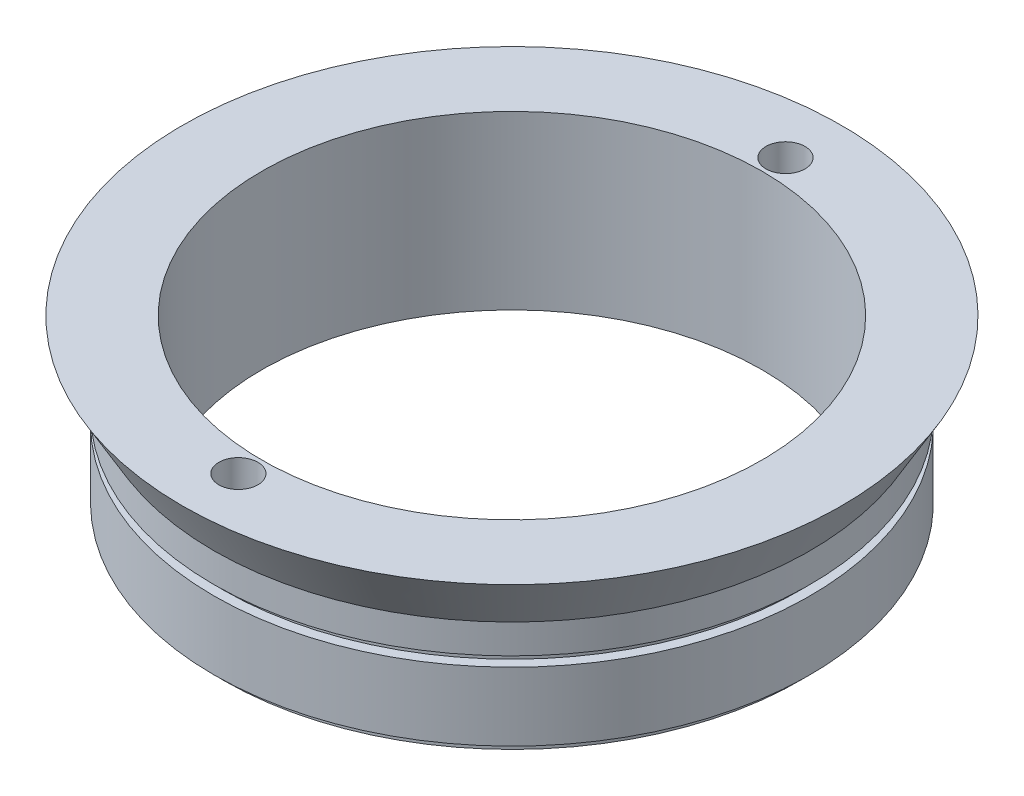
ISO-10303-21;
HEADER;
FILE_DESCRIPTION(('STEP AP214'),'2;1');
FILE_NAME('part.step','',(''),(''),'','','');
FILE_SCHEMA(('AUTOMOTIVE_DESIGN { 1 0 10303 214 1 1 1 1 }'));
ENDSEC;
DATA;
#1=APPLICATION_CONTEXT('core data for automotive mechanical design processes');
#2=APPLICATION_PROTOCOL_DEFINITION('international standard','automotive_design',2000,#1);
#3=PRODUCT_CONTEXT('',#1,'mechanical');
#4=PRODUCT('Part','Part','',(#3));
#5=PRODUCT_RELATED_PRODUCT_CATEGORY('part','',(#4));
#6=PRODUCT_DEFINITION_FORMATION('','',#4);
#7=PRODUCT_DEFINITION_CONTEXT('part definition',#1,'design');
#8=PRODUCT_DEFINITION('design','',#6,#7);
#9=PRODUCT_DEFINITION_SHAPE('','',#8);
#10=(LENGTH_UNIT() NAMED_UNIT(*) SI_UNIT(.MILLI.,.METRE.));
#11=(NAMED_UNIT(*) PLANE_ANGLE_UNIT() SI_UNIT($,.RADIAN.));
#12=(NAMED_UNIT(*) SI_UNIT($,.STERADIAN.) SOLID_ANGLE_UNIT());
#13=UNCERTAINTY_MEASURE_WITH_UNIT(LENGTH_MEASURE(1.E-05),#10,'distance_accuracy_value','');
#14=(GEOMETRIC_REPRESENTATION_CONTEXT(3) GLOBAL_UNCERTAINTY_ASSIGNED_CONTEXT((#13)) GLOBAL_UNIT_ASSIGNED_CONTEXT((#10,
#11,#12)) REPRESENTATION_CONTEXT('',''));
#15=CARTESIAN_POINT('',(0.,0.,0.));
#16=DIRECTION('',(0.,0.,1.));
#17=DIRECTION('',(1.,0.,0.));
#18=AXIS2_PLACEMENT_3D('',#15,#16,#17);
#19=CARTESIAN_POINT('',(0.,8.8,0.));
#20=DIRECTION('',(0.,1.,0.));
#21=DIRECTION('',(0.,0.,1.));
#22=AXIS2_PLACEMENT_3D('',#19,#20,#21);
#23=CYLINDRICAL_SURFACE('',#22,15.25);
#24=CARTESIAN_POINT('',(0.,0.5,0.));
#25=DIRECTION('',(0.,1.,0.));
#26=DIRECTION('',(0.,0.,1.));
#27=AXIS2_PLACEMENT_3D('',#24,#25,#26);
#28=CIRCLE('',#27,15.25);
#29=CARTESIAN_POINT('',(0.,0.5,15.25));
#30=VERTEX_POINT('',#29);
#31=EDGE_CURVE('E75',#30,#30,#28,.T.);
#32=ORIENTED_EDGE('',*,*,#31,.T.);
#33=EDGE_LOOP('',(#32));
#34=FACE_BOUND('',#33,.T.);
#35=CARTESIAN_POINT('',(0.,4.,0.));
#36=DIRECTION('',(0.,1.,0.));
#37=DIRECTION('',(0.,0.,1.));
#38=AXIS2_PLACEMENT_3D('',#35,#36,#37);
#39=CIRCLE('',#38,15.25);
#40=CARTESIAN_POINT('',(0.,4.,15.25));
#41=VERTEX_POINT('',#40);
#42=EDGE_CURVE('E87',#41,#41,#39,.T.);
#43=ORIENTED_EDGE('',*,*,#42,.F.);
#44=EDGE_LOOP('',(#43));
#45=FACE_BOUND('',#44,.T.);
#46=ADVANCED_FACE('F34',(#34,#45),#23,.T.);
#47=CARTESIAN_POINT('',(0.,0.,0.));
#48=DIRECTION('',(0.,1.,0.));
#49=DIRECTION('',(0.,0.,1.));
#50=AXIS2_PLACEMENT_3D('',#47,#48,#49);
#51=PLANE('',#50);
#52=CARTESIAN_POINT('',(0.,0.,0.));
#53=DIRECTION('',(0.,1.,0.));
#54=DIRECTION('',(0.,0.,1.));
#55=AXIS2_PLACEMENT_3D('',#52,#53,#54);
#56=CIRCLE('',#55,14.75);
#57=CARTESIAN_POINT('',(0.,0.,14.75));
#58=VERTEX_POINT('',#57);
#59=EDGE_CURVE('E69',#58,#58,#56,.T.);
#60=ORIENTED_EDGE('',*,*,#59,.F.);
#61=EDGE_LOOP('',(#60));
#62=FACE_BOUND('',#61,.T.);
#63=CARTESIAN_POINT('',(0.,0.,0.));
#64=DIRECTION('',(0.,-1.,0.));
#65=DIRECTION('',(0.,0.,-1.));
#66=AXIS2_PLACEMENT_3D('',#63,#64,#65);
#67=CIRCLE('',#66,12.8016);
#68=CARTESIAN_POINT('',(0.,0.,-12.8016));
#69=VERTEX_POINT('',#68);
#70=EDGE_CURVE('E90',#69,#69,#67,.T.);
#71=ORIENTED_EDGE('',*,*,#70,.F.);
#72=EDGE_LOOP('',(#71));
#73=FACE_BOUND('',#72,.T.);
#74=ADVANCED_FACE('F36',(#62,#73),#51,.F.);
#75=CARTESIAN_POINT('',(0.,4.5,0.));
#76=DIRECTION('',(0.,1.,0.));
#77=DIRECTION('',(0.,0.,1.));
#78=AXIS2_PLACEMENT_3D('',#75,#76,#77);
#79=CIRCLE('',#78,15.25);
#80=CARTESIAN_POINT('',(0.,4.5,15.25));
#81=VERTEX_POINT('',#80);
#82=EDGE_CURVE('E78',#81,#81,#79,.T.);
#83=ORIENTED_EDGE('',*,*,#82,.T.);
#84=EDGE_LOOP('',(#83));
#85=FACE_BOUND('',#84,.T.);
#86=CARTESIAN_POINT('',(0.,6.,0.));
#87=DIRECTION('',(0.,1.,0.));
#88=DIRECTION('',(0.,0.,1.));
#89=AXIS2_PLACEMENT_3D('',#86,#87,#88);
#90=CIRCLE('',#89,15.25);
#91=CARTESIAN_POINT('',(0.,6.,15.25));
#92=VERTEX_POINT('',#91);
#93=EDGE_CURVE('E11',#92,#92,#90,.T.);
#94=ORIENTED_EDGE('',*,*,#93,.F.);
#95=EDGE_LOOP('',(#94));
#96=FACE_BOUND('',#95,.T.);
#97=ADVANCED_FACE('F103',(#85,#96),#23,.T.);
#98=CARTESIAN_POINT('',(0.,6.,0.));
#99=DIRECTION('',(0.,1.,0.));
#100=DIRECTION('',(0.,0.,1.));
#101=AXIS2_PLACEMENT_3D('',#98,#99,#100);
#102=CONICAL_SURFACE('',#101,15.25,0.523598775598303);
#103=CARTESIAN_POINT('',(0.,8.8,0.));
#104=DIRECTION('',(0.,1.,0.));
#105=DIRECTION('',(0.,0.,1.));
#106=AXIS2_PLACEMENT_3D('',#103,#104,#105);
#107=CIRCLE('',#106,16.866580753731);
#108=CARTESIAN_POINT('',(0.,8.8,16.866580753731));
#109=VERTEX_POINT('',#108);
#110=EDGE_CURVE('E42',#109,#109,#107,.T.);
#111=ORIENTED_EDGE('',*,*,#110,.F.);
#112=EDGE_LOOP('',(#111));
#113=FACE_BOUND('',#112,.T.);
#114=ORIENTED_EDGE('',*,*,#93,.T.);
#115=EDGE_LOOP('',(#114));
#116=FACE_BOUND('',#115,.T.);
#117=ADVANCED_FACE('F100',(#113,#116),#102,.T.);
#118=CARTESIAN_POINT('',(0.,8.8,-16.866580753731));
#119=DIRECTION('',(0.,-1.,0.));
#120=DIRECTION('',(0.,0.,-1.));
#121=AXIS2_PLACEMENT_3D('',#118,#119,#120);
#122=PLANE('',#121);
#123=CARTESIAN_POINT('',(0.,8.8,-14.));
#124=DIRECTION('',(0.,1.,0.));
#125=DIRECTION('',(0.,0.,1.));
#126=AXIS2_PLACEMENT_3D('',#123,#124,#125);
#127=CIRCLE('',#126,0.999999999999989);
#128=CARTESIAN_POINT('',(0.,8.8,-13.));
#129=VERTEX_POINT('',#128);
#130=EDGE_CURVE('E59',#129,#129,#127,.T.);
#131=ORIENTED_EDGE('',*,*,#130,.F.);
#132=EDGE_LOOP('',(#131));
#133=FACE_BOUND('',#132,.T.);
#134=CARTESIAN_POINT('',(0.,8.8,14.));
#135=DIRECTION('',(0.,1.,0.));
#136=DIRECTION('',(0.,0.,1.));
#137=AXIS2_PLACEMENT_3D('',#134,#135,#136);
#138=CIRCLE('',#137,0.999999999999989);
#139=CARTESIAN_POINT('',(0.,8.8,15.));
#140=VERTEX_POINT('',#139);
#141=EDGE_CURVE('E58',#140,#140,#138,.T.);
#142=ORIENTED_EDGE('',*,*,#141,.F.);
#143=EDGE_LOOP('',(#142));
#144=FACE_BOUND('',#143,.T.);
#145=CARTESIAN_POINT('',(0.,8.8,0.));
#146=DIRECTION('',(0.,-1.,0.));
#147=DIRECTION('',(0.,0.,-1.));
#148=AXIS2_PLACEMENT_3D('',#145,#146,#147);
#149=CIRCLE('',#148,12.8016);
#150=CARTESIAN_POINT('',(0.,8.8,-12.8016));
#151=VERTEX_POINT('',#150);
#152=EDGE_CURVE('E91',#151,#151,#149,.T.);
#153=ORIENTED_EDGE('',*,*,#152,.T.);
#154=EDGE_LOOP('',(#153));
#155=FACE_BOUND('',#154,.T.);
#156=ORIENTED_EDGE('',*,*,#110,.T.);
#157=EDGE_LOOP('',(#156));
#158=FACE_BOUND('',#157,.T.);
#159=ADVANCED_FACE('F98',(#133,#144,#155,#158),#122,.F.);
#160=CARTESIAN_POINT('',(0.,8.8,0.));
#161=DIRECTION('',(0.,-1.,0.));
#162=DIRECTION('',(0.,0.,-1.));
#163=AXIS2_PLACEMENT_3D('',#160,#161,#162);
#164=CYLINDRICAL_SURFACE('',#163,12.8016);
#165=ORIENTED_EDGE('',*,*,#152,.F.);
#166=EDGE_LOOP('',(#165));
#167=FACE_BOUND('',#166,.T.);
#168=ORIENTED_EDGE('',*,*,#70,.T.);
#169=EDGE_LOOP('',(#168));
#170=FACE_BOUND('',#169,.T.);
#171=ADVANCED_FACE('F124',(#167,#170),#164,.F.);
#172=CARTESIAN_POINT('',(0.,4.,15.25));
#173=DIRECTION('',(0.,-1.,0.));
#174=DIRECTION('',(0.,0.,-1.));
#175=AXIS2_PLACEMENT_3D('',#172,#173,#174);
#176=PLANE('',#175);
#177=CARTESIAN_POINT('',(0.,4.,0.));
#178=DIRECTION('',(0.,1.,0.));
#179=DIRECTION('',(0.,0.,1.));
#180=AXIS2_PLACEMENT_3D('',#177,#178,#179);
#181=CIRCLE('',#180,14.75);
#182=CARTESIAN_POINT('',(0.,4.,14.75));
#183=VERTEX_POINT('',#182);
#184=EDGE_CURVE('E84',#183,#183,#181,.T.);
#185=ORIENTED_EDGE('',*,*,#184,.F.);
#186=EDGE_LOOP('',(#185));
#187=FACE_BOUND('',#186,.T.);
#188=ORIENTED_EDGE('',*,*,#42,.T.);
#189=EDGE_LOOP('',(#188));
#190=FACE_BOUND('',#189,.T.);
#191=ADVANCED_FACE('F121',(#187,#190),#176,.F.);
#192=CARTESIAN_POINT('',(0.,8.8,0.));
#193=DIRECTION('',(0.,1.,0.));
#194=DIRECTION('',(0.,0.,1.));
#195=AXIS2_PLACEMENT_3D('',#192,#193,#194);
#196=CYLINDRICAL_SURFACE('',#195,14.75);
#197=CARTESIAN_POINT('',(0.,4.5,0.));
#198=DIRECTION('',(0.,1.,0.));
#199=DIRECTION('',(0.,0.,1.));
#200=AXIS2_PLACEMENT_3D('',#197,#198,#199);
#201=CIRCLE('',#200,14.75);
#202=CARTESIAN_POINT('',(0.,4.5,14.75));
#203=VERTEX_POINT('',#202);
#204=EDGE_CURVE('E81',#203,#203,#201,.T.);
#205=ORIENTED_EDGE('',*,*,#204,.F.);
#206=EDGE_LOOP('',(#205));
#207=FACE_BOUND('',#206,.T.);
#208=ORIENTED_EDGE('',*,*,#184,.T.);
#209=EDGE_LOOP('',(#208));
#210=FACE_BOUND('',#209,.T.);
#211=ADVANCED_FACE('F123',(#207,#210),#196,.T.);
#212=CARTESIAN_POINT('',(0.,4.5,15.25));
#213=DIRECTION('',(0.,1.,0.));
#214=DIRECTION('',(0.,0.,1.));
#215=AXIS2_PLACEMENT_3D('',#212,#213,#214);
#216=PLANE('',#215);
#217=ORIENTED_EDGE('',*,*,#82,.F.);
#218=EDGE_LOOP('',(#217));
#219=FACE_BOUND('',#218,.T.);
#220=ORIENTED_EDGE('',*,*,#204,.T.);
#221=EDGE_LOOP('',(#220));
#222=FACE_BOUND('',#221,.T.);
#223=ADVANCED_FACE('F131',(#219,#222),#216,.F.);
#224=CARTESIAN_POINT('',(0.,0.5,15.25));
#225=DIRECTION('',(0.,1.,0.));
#226=DIRECTION('',(0.,0.,1.));
#227=AXIS2_PLACEMENT_3D('',#224,#225,#226);
#228=PLANE('',#227);
#229=ORIENTED_EDGE('',*,*,#31,.F.);
#230=EDGE_LOOP('',(#229));
#231=FACE_BOUND('',#230,.T.);
#232=CARTESIAN_POINT('',(0.,0.5,0.));
#233=DIRECTION('',(0.,1.,0.));
#234=DIRECTION('',(0.,0.,1.));
#235=AXIS2_PLACEMENT_3D('',#232,#233,#234);
#236=CIRCLE('',#235,14.75);
#237=CARTESIAN_POINT('',(0.,0.5,14.75));
#238=VERTEX_POINT('',#237);
#239=EDGE_CURVE('E72',#238,#238,#236,.T.);
#240=ORIENTED_EDGE('',*,*,#239,.T.);
#241=EDGE_LOOP('',(#240));
#242=FACE_BOUND('',#241,.T.);
#243=ADVANCED_FACE('F166',(#231,#242),#228,.F.);
#244=CARTESIAN_POINT('',(0.,8.8,0.));
#245=DIRECTION('',(0.,1.,0.));
#246=DIRECTION('',(0.,0.,1.));
#247=AXIS2_PLACEMENT_3D('',#244,#245,#246);
#248=CYLINDRICAL_SURFACE('',#247,14.75);
#249=ORIENTED_EDGE('',*,*,#239,.F.);
#250=EDGE_LOOP('',(#249));
#251=FACE_BOUND('',#250,.T.);
#252=ORIENTED_EDGE('',*,*,#59,.T.);
#253=EDGE_LOOP('',(#252));
#254=FACE_BOUND('',#253,.T.);
#255=ADVANCED_FACE('F159',(#251,#254),#248,.T.);
#256=CARTESIAN_POINT('',(0.,5.8,14.));
#257=DIRECTION('',(0.,1.,0.));
#258=DIRECTION('',(0.,0.,1.));
#259=AXIS2_PLACEMENT_3D('',#256,#257,#258);
#260=CONICAL_SURFACE('',#259,0.999999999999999,1.02974425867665);
#261=CARTESIAN_POINT('',(0.,5.19913938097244,14.));
#262=VERTEX_POINT('',#261);
#263=VERTEX_LOOP('',#262);
#264=FACE_BOUND('',#263,.T.);
#265=CARTESIAN_POINT('',(0.,5.8,14.));
#266=DIRECTION('',(0.,1.,0.));
#267=DIRECTION('',(0.,0.,1.));
#268=AXIS2_PLACEMENT_3D('',#265,#266,#267);
#269=CIRCLE('',#268,0.999999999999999);
#270=CARTESIAN_POINT('',(0.,5.8,15.));
#271=VERTEX_POINT('',#270);
#272=EDGE_CURVE('E62',#271,#271,#269,.T.);
#273=ORIENTED_EDGE('',*,*,#272,.T.);
#274=EDGE_LOOP('',(#273));
#275=FACE_BOUND('',#274,.T.);
#276=ADVANCED_FACE('F153',(#264,#275),#260,.F.);
#277=CARTESIAN_POINT('',(0.,8.8,14.));
#278=DIRECTION('',(0.,1.,0.));
#279=DIRECTION('',(0.,0.,1.));
#280=AXIS2_PLACEMENT_3D('',#277,#278,#279);
#281=CYLINDRICAL_SURFACE('',#280,0.999999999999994);
#282=ORIENTED_EDGE('',*,*,#272,.F.);
#283=EDGE_LOOP('',(#282));
#284=FACE_BOUND('',#283,.T.);
#285=ORIENTED_EDGE('',*,*,#141,.T.);
#286=EDGE_LOOP('',(#285));
#287=FACE_BOUND('',#286,.T.);
#288=ADVANCED_FACE('F52',(#284,#287),#281,.F.);
#289=CARTESIAN_POINT('',(0.,5.8,-14.));
#290=DIRECTION('',(0.,1.,0.));
#291=DIRECTION('',(0.,0.,1.));
#292=AXIS2_PLACEMENT_3D('',#289,#290,#291);
#293=CONICAL_SURFACE('',#292,0.999999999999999,1.02974425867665);
#294=CARTESIAN_POINT('',(0.,5.19913938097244,-14.));
#295=VERTEX_POINT('',#294);
#296=VERTEX_LOOP('',#295);
#297=FACE_BOUND('',#296,.T.);
#298=CARTESIAN_POINT('',(0.,5.8,-14.));
#299=DIRECTION('',(0.,1.,0.));
#300=DIRECTION('',(0.,0.,1.));
#301=AXIS2_PLACEMENT_3D('',#298,#299,#300);
#302=CIRCLE('',#301,0.999999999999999);
#303=CARTESIAN_POINT('',(0.,5.8,-13.));
#304=VERTEX_POINT('',#303);
#305=EDGE_CURVE('E56',#304,#304,#302,.T.);
#306=ORIENTED_EDGE('',*,*,#305,.T.);
#307=EDGE_LOOP('',(#306));
#308=FACE_BOUND('',#307,.T.);
#309=ADVANCED_FACE('F48',(#297,#308),#293,.F.);
#310=CARTESIAN_POINT('',(0.,8.8,-14.));
#311=DIRECTION('',(0.,1.,0.));
#312=DIRECTION('',(0.,0.,1.));
#313=AXIS2_PLACEMENT_3D('',#310,#311,#312);
#314=CYLINDRICAL_SURFACE('',#313,0.999999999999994);
#315=ORIENTED_EDGE('',*,*,#305,.F.);
#316=EDGE_LOOP('',(#315));
#317=FACE_BOUND('',#316,.T.);
#318=ORIENTED_EDGE('',*,*,#130,.T.);
#319=EDGE_LOOP('',(#318));
#320=FACE_BOUND('',#319,.T.);
#321=ADVANCED_FACE('F51',(#317,#320),#314,.F.);
#322=CLOSED_SHELL('',(#46,#74,#97,#117,#159,#171,#191,#211,#223,#243,#255,#276,#288,#309,#321));
#323=MANIFOLD_SOLID_BREP('B2',#322);
#324=ADVANCED_BREP_SHAPE_REPRESENTATION('',(#18,#323),#14);
#325=SHAPE_DEFINITION_REPRESENTATION(#9,#324);
ENDSEC;
END-ISO-10303-21;
